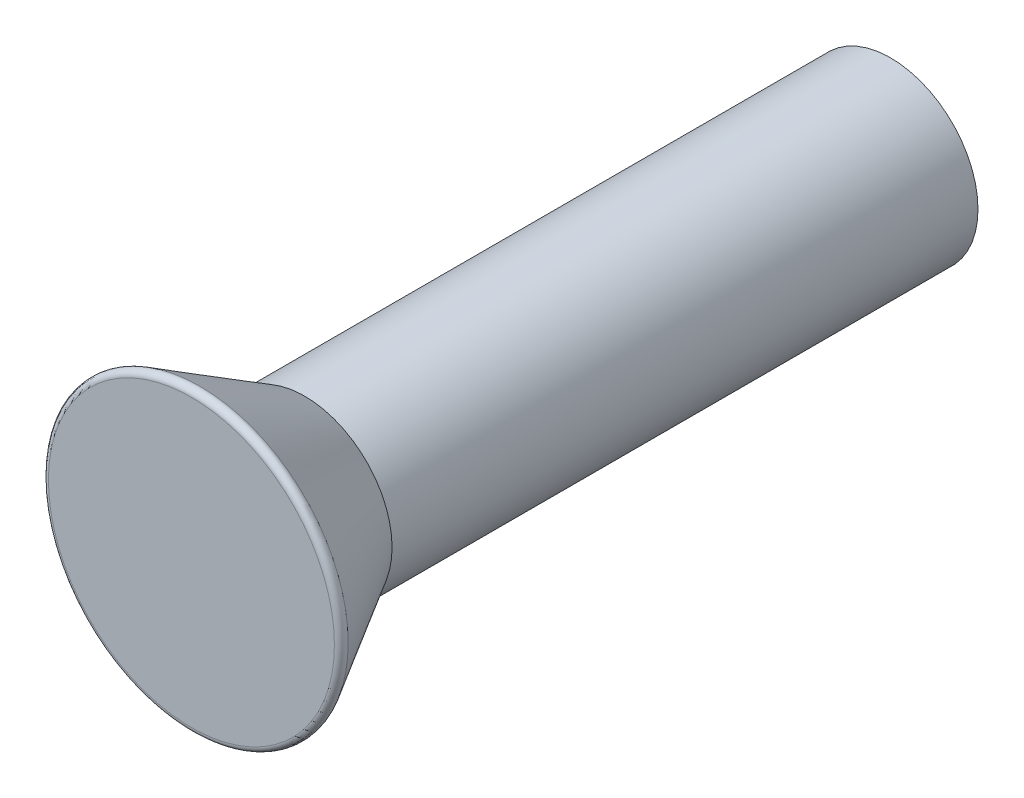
ISO-10303-21;
HEADER;
FILE_DESCRIPTION(('STEP AP214'),'2;1');
FILE_NAME('part.step','',(''),(''),'','','');
FILE_SCHEMA(('AUTOMOTIVE_DESIGN { 1 0 10303 214 1 1 1 1 }'));
ENDSEC;
DATA;
#1=APPLICATION_CONTEXT('core data for automotive mechanical design processes');
#2=APPLICATION_PROTOCOL_DEFINITION('international standard','automotive_design',2000,#1);
#3=PRODUCT_CONTEXT('',#1,'mechanical');
#4=PRODUCT('Part','Part','',(#3));
#5=PRODUCT_RELATED_PRODUCT_CATEGORY('part','',(#4));
#6=PRODUCT_DEFINITION_FORMATION('','',#4);
#7=PRODUCT_DEFINITION_CONTEXT('part definition',#1,'design');
#8=PRODUCT_DEFINITION('design','',#6,#7);
#9=PRODUCT_DEFINITION_SHAPE('','',#8);
#10=(LENGTH_UNIT() NAMED_UNIT(*) SI_UNIT(.MILLI.,.METRE.));
#11=(NAMED_UNIT(*) PLANE_ANGLE_UNIT() SI_UNIT($,.RADIAN.));
#12=(NAMED_UNIT(*) SI_UNIT($,.STERADIAN.) SOLID_ANGLE_UNIT());
#13=UNCERTAINTY_MEASURE_WITH_UNIT(LENGTH_MEASURE(1.E-05),#10,'distance_accuracy_value','');
#14=(GEOMETRIC_REPRESENTATION_CONTEXT(3) GLOBAL_UNCERTAINTY_ASSIGNED_CONTEXT((#13)) GLOBAL_UNIT_ASSIGNED_CONTEXT((#10,
#11,#12)) REPRESENTATION_CONTEXT('',''));
#15=CARTESIAN_POINT('',(0.,0.,0.));
#16=DIRECTION('',(0.,0.,1.));
#17=DIRECTION('',(1.,0.,0.));
#18=AXIS2_PLACEMENT_3D('',#15,#16,#17);
#19=CARTESIAN_POINT('',(0.,0.,-25.4));
#20=DIRECTION('',(0.,0.,1.));
#21=DIRECTION('',(1.,0.,0.));
#22=AXIS2_PLACEMENT_3D('',#19,#20,#21);
#23=PLANE('',#22);
#24=CARTESIAN_POINT('',(0.,0.,-25.4));
#25=DIRECTION('',(0.,0.,1.));
#26=DIRECTION('',(1.,0.,0.));
#27=AXIS2_PLACEMENT_3D('',#24,#25,#26);
#28=CIRCLE('',#27,3.175);
#29=CARTESIAN_POINT('',(3.175,0.,-25.4));
#30=VERTEX_POINT('',#29);
#31=EDGE_CURVE('E48',#30,#30,#28,.T.);
#32=ORIENTED_EDGE('',*,*,#31,.F.);
#33=EDGE_LOOP('',(#32));
#34=FACE_BOUND('',#33,.T.);
#35=ADVANCED_FACE('F37',(#34),#23,.F.);
#36=CARTESIAN_POINT('',(0.,0.,0.));
#37=DIRECTION('',(0.,0.,1.));
#38=DIRECTION('',(1.,0.,0.));
#39=AXIS2_PLACEMENT_3D('',#36,#37,#38);
#40=CYLINDRICAL_SURFACE('',#39,3.175);
#41=CARTESIAN_POINT('',(0.,0.,-4.1148));
#42=DIRECTION('',(0.,0.,1.));
#43=DIRECTION('',(1.,0.,0.));
#44=AXIS2_PLACEMENT_3D('',#41,#42,#43);
#45=CIRCLE('',#44,3.175);
#46=CARTESIAN_POINT('',(3.175,0.,-4.1148));
#47=VERTEX_POINT('',#46);
#48=EDGE_CURVE('E52',#47,#47,#45,.T.);
#49=ORIENTED_EDGE('',*,*,#48,.F.);
#50=EDGE_LOOP('',(#49));
#51=FACE_BOUND('',#50,.T.);
#52=ORIENTED_EDGE('',*,*,#31,.T.);
#53=EDGE_LOOP('',(#52));
#54=FACE_BOUND('',#53,.T.);
#55=ADVANCED_FACE('F60',(#51,#54),#40,.T.);
#56=CARTESIAN_POINT('',(0.,0.,-4.1148));
#57=DIRECTION('',(0.,0.,1.));
#58=DIRECTION('',(1.,0.,0.));
#59=AXIS2_PLACEMENT_3D('',#56,#57,#58);
#60=CONICAL_SURFACE('',#59,3.175,0.525768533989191);
#61=CARTESIAN_POINT('',(0.,0.,-0.317897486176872));
#62=DIRECTION('',(0.,0.,-1.));
#63=DIRECTION('',(-1.,0.,0.));
#64=AXIS2_PLACEMENT_3D('',#61,#62,#63);
#65=CIRCLE('',#64,5.37814096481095);
#66=CARTESIAN_POINT('',(-5.37814096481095,0.,-0.317897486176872));
#67=VERTEX_POINT('',#66);
#68=EDGE_CURVE('E10',#67,#67,#65,.T.);
#69=ORIENTED_EDGE('',*,*,#68,.T.);
#70=EDGE_LOOP('',(#69));
#71=FACE_BOUND('',#70,.T.);
#72=ORIENTED_EDGE('',*,*,#48,.T.);
#73=EDGE_LOOP('',(#72));
#74=FACE_BOUND('',#73,.T.);
#75=ADVANCED_FACE('F58',(#71,#74),#60,.T.);
#76=CARTESIAN_POINT('',(0.,0.,0.));
#77=DIRECTION('',(0.,0.,-1.));
#78=DIRECTION('',(-1.,0.,0.));
#79=AXIS2_PLACEMENT_3D('',#76,#77,#78);
#80=PLANE('',#79);
#81=CARTESIAN_POINT('',(0.,0.,0.));
#82=DIRECTION('',(0.,0.,-1.));
#83=DIRECTION('',(-1.,0.,0.));
#84=AXIS2_PLACEMENT_3D('',#81,#82,#83);
#85=CIRCLE('',#84,5.19506231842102);
#86=CARTESIAN_POINT('',(-5.19506231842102,0.,0.));
#87=VERTEX_POINT('',#86);
#88=EDGE_CURVE('E44',#87,#87,#85,.F.);
#89=ORIENTED_EDGE('',*,*,#88,.T.);
#90=EDGE_LOOP('',(#89));
#91=FACE_BOUND('',#90,.T.);
#92=ADVANCED_FACE('F72',(#91),#80,.F.);
#93=CARTESIAN_POINT('',(0.,0.,-0.211666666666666));
#94=DIRECTION('',(0.,0.,-1.));
#95=DIRECTION('',(-1.,0.,0.));
#96=AXIS2_PLACEMENT_3D('',#93,#94,#95);
#97=TOROIDAL_SURFACE('',#96,5.19506231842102,0.211666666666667);
#98=ORIENTED_EDGE('',*,*,#68,.F.);
#99=EDGE_LOOP('',(#98));
#100=FACE_BOUND('',#99,.T.);
#101=ORIENTED_EDGE('',*,*,#88,.F.);
#102=EDGE_LOOP('',(#101));
#103=FACE_BOUND('',#102,.T.);
#104=ADVANCED_FACE('F39',(#100,#103),#97,.T.);
#105=CLOSED_SHELL('',(#35,#55,#75,#92,#104));
#106=MANIFOLD_SOLID_BREP('B2',#105);
#107=ADVANCED_BREP_SHAPE_REPRESENTATION('',(#18,#106),#14);
#108=SHAPE_DEFINITION_REPRESENTATION(#9,#107);
ENDSEC;
END-ISO-10303-21;
